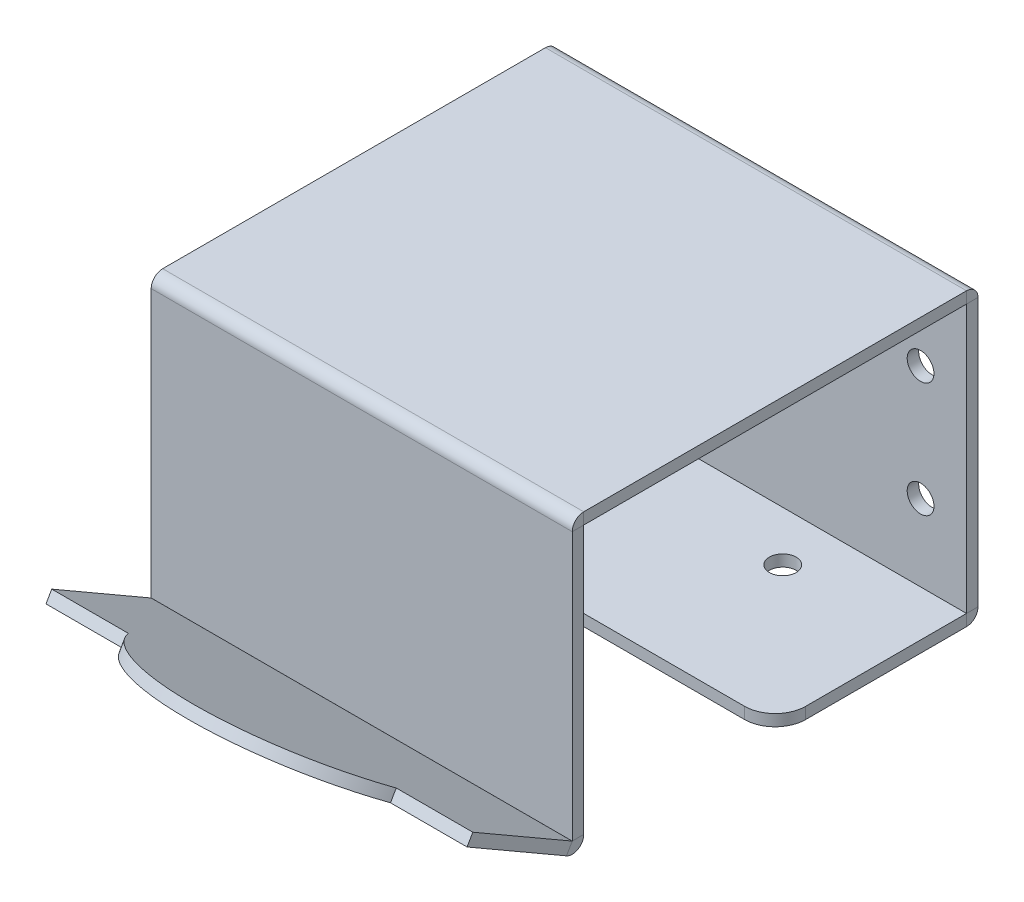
ISO-10303-21;
HEADER;
FILE_DESCRIPTION(('STEP AP214'),'2;1');
FILE_NAME('part.step','',(''),(''),'','','');
FILE_SCHEMA(('AUTOMOTIVE_DESIGN { 1 0 10303 214 1 1 1 1 }'));
ENDSEC;
DATA;
#1=APPLICATION_CONTEXT('core data for automotive mechanical design processes');
#2=APPLICATION_PROTOCOL_DEFINITION('international standard','automotive_design',2000,#1);
#3=PRODUCT_CONTEXT('',#1,'mechanical');
#4=PRODUCT('Part','Part','',(#3));
#5=PRODUCT_RELATED_PRODUCT_CATEGORY('part','',(#4));
#6=PRODUCT_DEFINITION_FORMATION('','',#4);
#7=PRODUCT_DEFINITION_CONTEXT('part definition',#1,'design');
#8=PRODUCT_DEFINITION('design','',#6,#7);
#9=PRODUCT_DEFINITION_SHAPE('','',#8);
#10=(LENGTH_UNIT() NAMED_UNIT(*) SI_UNIT(.MILLI.,.METRE.));
#11=(NAMED_UNIT(*) PLANE_ANGLE_UNIT() SI_UNIT($,.RADIAN.));
#12=(NAMED_UNIT(*) SI_UNIT($,.STERADIAN.) SOLID_ANGLE_UNIT());
#13=UNCERTAINTY_MEASURE_WITH_UNIT(LENGTH_MEASURE(1.E-05),#10,'distance_accuracy_value','');
#14=(GEOMETRIC_REPRESENTATION_CONTEXT(3) GLOBAL_UNCERTAINTY_ASSIGNED_CONTEXT((#13)) GLOBAL_UNIT_ASSIGNED_CONTEXT((#10,
#11,#12)) REPRESENTATION_CONTEXT('',''));
#15=CARTESIAN_POINT('',(0.,0.,0.));
#16=DIRECTION('',(0.,0.,1.));
#17=DIRECTION('',(1.,0.,0.));
#18=AXIS2_PLACEMENT_3D('',#15,#16,#17);
#19=CARTESIAN_POINT('',(51.,166.000023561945,51.4999764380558));
#20=DIRECTION('',(0.,0.,-1.));
#21=DIRECTION('',(1.,0.,0.));
#22=AXIS2_PLACEMENT_3D('',#19,#20,#21);
#23=PLANE('',#22);
#24=DIRECTION('',(0.,-1.,0.));
#25=VECTOR('',#24,1.);
#26=CARTESIAN_POINT('',(55.,166.000023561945,51.4999764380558));
#27=LINE('',#26,#25);
#28=CARTESIAN_POINT('',(55.,59.9999999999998,51.4999764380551));
#29=VERTEX_POINT('',#28);
#30=CARTESIAN_POINT('',(55.,25.0000235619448,51.4999764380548));
#31=VERTEX_POINT('',#30);
#32=EDGE_CURVE('E52',#29,#31,#27,.T.);
#33=ORIENTED_EDGE('',*,*,#32,.T.);
#34=DIRECTION('',(-1.,0.,0.));
#35=VECTOR('',#34,1.);
#36=CARTESIAN_POINT('',(51.,25.0000235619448,51.4999764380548));
#37=LINE('',#36,#35);
#38=CARTESIAN_POINT('',(0.,25.0000235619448,51.4999764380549));
#39=VERTEX_POINT('',#38);
#40=EDGE_CURVE('E401',#31,#39,#37,.T.);
#41=ORIENTED_EDGE('',*,*,#40,.T.);
#42=DIRECTION('',(0.,1.,0.));
#43=VECTOR('',#42,1.);
#44=CARTESIAN_POINT('',(0.,166.000023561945,51.4999764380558));
#45=LINE('',#44,#43);
#46=CARTESIAN_POINT('',(0.,59.9999999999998,51.4999764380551));
#47=VERTEX_POINT('',#46);
#48=EDGE_CURVE('E250',#39,#47,#45,.T.);
#49=ORIENTED_EDGE('',*,*,#48,.T.);
#50=DIRECTION('',(-1.,0.,0.));
#51=VECTOR('',#50,1.);
#52=CARTESIAN_POINT('',(51.,59.9999999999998,51.4999764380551));
#53=LINE('',#52,#51);
#54=EDGE_CURVE('E389',#29,#47,#53,.T.);
#55=ORIENTED_EDGE('',*,*,#54,.F.);
#56=EDGE_LOOP('',(#33,#41,#49,#55));
#57=FACE_BOUND('',#56,.T.);
#58=ADVANCED_FACE('F48',(#57),#23,.T.);
#59=CARTESIAN_POINT('',(51.,60.0000000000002,-54.5000235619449));
#60=DIRECTION('',(0.,-1.,0.));
#61=DIRECTION('',(1.,0.,0.));
#62=AXIS2_PLACEMENT_3D('',#59,#60,#61);
#63=PLANE('',#62);
#64=DIRECTION('',(0.,0.,1.));
#65=VECTOR('',#64,1.);
#66=CARTESIAN_POINT('',(55.,60.0000000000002,-54.5000235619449));
#67=LINE('',#66,#65);
#68=CARTESIAN_POINT('',(55.,60.,1.5));
#69=VERTEX_POINT('',#68);
#70=EDGE_CURVE('E383',#69,#29,#67,.T.);
#71=ORIENTED_EDGE('',*,*,#70,.T.);
#72=ORIENTED_EDGE('',*,*,#54,.T.);
#73=DIRECTION('',(0.,0.,-1.));
#74=VECTOR('',#73,1.);
#75=CARTESIAN_POINT('',(0.,60.0000000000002,-54.5000235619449));
#76=LINE('',#75,#74);
#77=CARTESIAN_POINT('',(0.,60.,1.5));
#78=VERTEX_POINT('',#77);
#79=EDGE_CURVE('E406',#47,#78,#76,.T.);
#80=ORIENTED_EDGE('',*,*,#79,.T.);
#81=DIRECTION('',(-1.,0.,0.));
#82=VECTOR('',#81,1.);
#83=CARTESIAN_POINT('',(51.,60.,1.5));
#84=LINE('',#83,#82);
#85=EDGE_CURVE('E293',#69,#78,#84,.T.);
#86=ORIENTED_EDGE('',*,*,#85,.F.);
#87=EDGE_LOOP('',(#71,#72,#80,#86));
#88=FACE_BOUND('',#87,.T.);
#89=ADVANCED_FACE('F466',(#88),#63,.T.);
#90=CARTESIAN_POINT('',(55.,60.0000000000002,-54.5000235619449));
#91=DIRECTION('',(-1.,0.,0.));
#92=DIRECTION('',(0.,-1.,0.));
#93=AXIS2_PLACEMENT_3D('',#90,#91,#92);
#94=PLANE('',#93);
#95=DIRECTION('',(0.,1.,0.));
#96=VECTOR('',#95,1.);
#97=CARTESIAN_POINT('',(55.,59.9999999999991,51.4999764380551));
#98=LINE('',#97,#96);
#99=CARTESIAN_POINT('',(55.,61.4999999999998,51.4999764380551));
#100=VERTEX_POINT('',#99);
#101=EDGE_CURVE('E392',#29,#100,#98,.T.);
#102=ORIENTED_EDGE('',*,*,#101,.F.);
#103=ORIENTED_EDGE('',*,*,#70,.F.);
#104=DIRECTION('',(0.,1.,0.));
#105=VECTOR('',#104,1.);
#106=CARTESIAN_POINT('',(55.,59.9999999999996,1.5));
#107=LINE('',#106,#105);
#108=CARTESIAN_POINT('',(55.,61.5,1.50000000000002));
#109=VERTEX_POINT('',#108);
#110=EDGE_CURVE('E386',#69,#109,#107,.T.);
#111=ORIENTED_EDGE('',*,*,#110,.T.);
#112=DIRECTION('',(0.,0.,1.));
#113=VECTOR('',#112,1.);
#114=CARTESIAN_POINT('',(55.,61.5000000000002,-54.5000235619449));
#115=LINE('',#114,#113);
#116=EDGE_CURVE('E404',#109,#100,#115,.T.);
#117=ORIENTED_EDGE('',*,*,#116,.T.);
#118=EDGE_LOOP('',(#102,#103,#111,#117));
#119=FACE_BOUND('',#118,.T.);
#120=ADVANCED_FACE('F455',(#119),#94,.F.);
#121=CARTESIAN_POINT('',(0.,60.0000000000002,-54.5000235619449));
#122=DIRECTION('',(1.,0.,0.));
#123=DIRECTION('',(0.,1.,0.));
#124=AXIS2_PLACEMENT_3D('',#121,#122,#123);
#125=PLANE('',#124);
#126=DIRECTION('',(0.,-1.,0.));
#127=VECTOR('',#126,1.);
#128=CARTESIAN_POINT('',(0.,59.9999999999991,51.4999764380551));
#129=LINE('',#128,#127);
#130=CARTESIAN_POINT('',(0.,61.4999999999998,51.4999764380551));
#131=VERTEX_POINT('',#130);
#132=EDGE_CURVE('E398',#131,#47,#129,.T.);
#133=ORIENTED_EDGE('',*,*,#132,.F.);
#134=DIRECTION('',(0.,0.,-1.));
#135=VECTOR('',#134,1.);
#136=CARTESIAN_POINT('',(0.,61.5000000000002,-54.5000235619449));
#137=LINE('',#136,#135);
#138=CARTESIAN_POINT('',(0.,61.5,1.50000000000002));
#139=VERTEX_POINT('',#138);
#140=EDGE_CURVE('E265',#131,#139,#137,.T.);
#141=ORIENTED_EDGE('',*,*,#140,.T.);
#142=DIRECTION('',(0.,-1.,0.));
#143=VECTOR('',#142,1.);
#144=CARTESIAN_POINT('',(0.,59.9999999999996,1.5));
#145=LINE('',#144,#143);
#146=EDGE_CURVE('E379',#139,#78,#145,.T.);
#147=ORIENTED_EDGE('',*,*,#146,.T.);
#148=ORIENTED_EDGE('',*,*,#79,.F.);
#149=EDGE_LOOP('',(#133,#141,#147,#148));
#150=FACE_BOUND('',#149,.T.);
#151=ADVANCED_FACE('F462',(#150),#125,.F.);
#152=CARTESIAN_POINT('',(51.,61.5000000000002,-54.5000235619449));
#153=DIRECTION('',(0.,-1.,0.));
#154=DIRECTION('',(1.,0.,0.));
#155=AXIS2_PLACEMENT_3D('',#152,#153,#154);
#156=PLANE('',#155);
#157=DIRECTION('',(-1.,0.,0.));
#158=VECTOR('',#157,1.);
#159=CARTESIAN_POINT('',(51.,61.4999999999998,51.4999764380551));
#160=LINE('',#159,#158);
#161=EDGE_CURVE('E395',#100,#131,#160,.T.);
#162=ORIENTED_EDGE('',*,*,#161,.F.);
#163=ORIENTED_EDGE('',*,*,#116,.F.);
#164=DIRECTION('',(-1.,0.,0.));
#165=VECTOR('',#164,1.);
#166=CARTESIAN_POINT('',(51.,61.5,1.50000000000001));
#167=LINE('',#166,#165);
#168=EDGE_CURVE('E382',#109,#139,#167,.T.);
#169=ORIENTED_EDGE('',*,*,#168,.T.);
#170=ORIENTED_EDGE('',*,*,#140,.F.);
#171=EDGE_LOOP('',(#162,#163,#169,#170));
#172=FACE_BOUND('',#171,.T.);
#173=ADVANCED_FACE('F460',(#172),#156,.F.);
#174=CARTESIAN_POINT('',(51.,23.5000000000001,22.4999764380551));
#175=DIRECTION('',(0.,1.,0.));
#176=DIRECTION('',(1.,0.,0.));
#177=AXIS2_PLACEMENT_3D('',#174,#175,#176);
#178=PLANE('',#177);
#179=DIRECTION('',(-1.,0.,0.));
#180=VECTOR('',#179,1.);
#181=CARTESIAN_POINT('',(51.,23.5,1.5));
#182=LINE('',#181,#180);
#183=CARTESIAN_POINT('',(55.,23.5,1.50000000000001));
#184=VERTEX_POINT('',#183);
#185=CARTESIAN_POINT('',(0.,23.5,1.50000000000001));
#186=VERTEX_POINT('',#185);
#187=EDGE_CURVE('E328',#184,#186,#182,.T.);
#188=ORIENTED_EDGE('',*,*,#187,.F.);
#189=DIRECTION('',(0.,0.,-1.));
#190=VECTOR('',#189,1.);
#191=CARTESIAN_POINT('',(55.,23.5000000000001,22.4999764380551));
#192=LINE('',#191,#190);
#193=CARTESIAN_POINT('',(55.,23.5000000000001,22.4999764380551));
#194=VERTEX_POINT('',#193);
#195=EDGE_CURVE('E343',#194,#184,#192,.T.);
#196=ORIENTED_EDGE('',*,*,#195,.F.);
#197=CARTESIAN_POINT('',(51.,23.5000000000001,22.4999764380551));
#198=DIRECTION('',(0.,1.,0.));
#199=DIRECTION('',(1.,0.,0.));
#200=AXIS2_PLACEMENT_3D('',#197,#198,#199);
#201=CIRCLE('',#200,4.);
#202=CARTESIAN_POINT('',(51.,23.5000000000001,26.4999764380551));
#203=VERTEX_POINT('',#202);
#204=EDGE_CURVE('E363',#203,#194,#201,.T.);
#205=ORIENTED_EDGE('',*,*,#204,.F.);
#206=DIRECTION('',(1.,0.,0.));
#207=VECTOR('',#206,1.);
#208=CARTESIAN_POINT('',(4.00000000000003,23.5000000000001,26.4999764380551));
#209=LINE('',#208,#207);
#210=CARTESIAN_POINT('',(4.00000000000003,23.5000000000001,26.4999764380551));
#211=VERTEX_POINT('',#210);
#212=EDGE_CURVE('E358',#211,#203,#209,.T.);
#213=ORIENTED_EDGE('',*,*,#212,.F.);
#214=CARTESIAN_POINT('',(4.,23.5000000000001,22.4999764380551));
#215=DIRECTION('',(0.,1.,0.));
#216=DIRECTION('',(-1.,0.,0.));
#217=AXIS2_PLACEMENT_3D('',#214,#215,#216);
#218=CIRCLE('',#217,4.);
#219=CARTESIAN_POINT('',(0.,23.5000000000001,22.4999764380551));
#220=VERTEX_POINT('',#219);
#221=EDGE_CURVE('E353',#220,#211,#218,.T.);
#222=ORIENTED_EDGE('',*,*,#221,.F.);
#223=DIRECTION('',(0.,0.,1.));
#224=VECTOR('',#223,1.);
#225=CARTESIAN_POINT('',(0.,23.5000000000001,22.4999764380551));
#226=LINE('',#225,#224);
#227=EDGE_CURVE('E348',#186,#220,#226,.T.);
#228=ORIENTED_EDGE('',*,*,#227,.F.);
#229=EDGE_LOOP('',(#188,#196,#205,#213,#222,#228));
#230=FACE_BOUND('',#229,.T.);
#231=CARTESIAN_POINT('',(17.5,23.5,7.99997643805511));
#232=DIRECTION('',(0.,1.,0.));
#233=DIRECTION('',(1.,0.,0.));
#234=AXIS2_PLACEMENT_3D('',#231,#232,#233);
#235=CIRCLE('',#234,1.75);
#236=CARTESIAN_POINT('',(19.25,23.5,7.99997643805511));
#237=VERTEX_POINT('',#236);
#238=EDGE_CURVE('E368',#237,#237,#235,.T.);
#239=ORIENTED_EDGE('',*,*,#238,.T.);
#240=EDGE_LOOP('',(#239));
#241=FACE_BOUND('',#240,.T.);
#242=CARTESIAN_POINT('',(37.5,23.5,7.99997643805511));
#243=DIRECTION('',(0.,1.,0.));
#244=DIRECTION('',(1.,0.,0.));
#245=AXIS2_PLACEMENT_3D('',#242,#243,#244);
#246=CIRCLE('',#245,1.75);
#247=CARTESIAN_POINT('',(39.25,23.5,7.99997643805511));
#248=VERTEX_POINT('',#247);
#249=EDGE_CURVE('E365',#248,#248,#246,.T.);
#250=ORIENTED_EDGE('',*,*,#249,.T.);
#251=EDGE_LOOP('',(#250));
#252=FACE_BOUND('',#251,.T.);
#253=ADVANCED_FACE('F515',(#230,#241,#252),#178,.F.);
#254=CARTESIAN_POINT('',(51.,25.0000000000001,22.4999764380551));
#255=DIRECTION('',(0.,-1.,0.));
#256=DIRECTION('',(-1.,0.,0.));
#257=AXIS2_PLACEMENT_3D('',#254,#255,#256);
#258=CYLINDRICAL_SURFACE('',#257,4.);
#259=ORIENTED_EDGE('',*,*,#204,.T.);
#260=DIRECTION('',(0.,-1.,0.));
#261=VECTOR('',#260,1.);
#262=CARTESIAN_POINT('',(55.,25.0000000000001,22.4999764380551));
#263=LINE('',#262,#261);
#264=CARTESIAN_POINT('',(55.,25.0000000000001,22.4999764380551));
#265=VERTEX_POINT('',#264);
#266=EDGE_CURVE('E345',#265,#194,#263,.T.);
#267=ORIENTED_EDGE('',*,*,#266,.F.);
#268=CARTESIAN_POINT('',(51.,25.0000000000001,22.4999764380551));
#269=DIRECTION('',(0.,1.,0.));
#270=DIRECTION('',(1.,0.,0.));
#271=AXIS2_PLACEMENT_3D('',#268,#269,#270);
#272=CIRCLE('',#271,4.);
#273=CARTESIAN_POINT('',(51.,25.0000000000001,26.4999764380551));
#274=VERTEX_POINT('',#273);
#275=EDGE_CURVE('E310',#274,#265,#272,.T.);
#276=ORIENTED_EDGE('',*,*,#275,.F.);
#277=DIRECTION('',(0.,-1.,0.));
#278=VECTOR('',#277,1.);
#279=CARTESIAN_POINT('',(51.,25.0000000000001,26.4999764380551));
#280=LINE('',#279,#278);
#281=EDGE_CURVE('E360',#274,#203,#280,.T.);
#282=ORIENTED_EDGE('',*,*,#281,.T.);
#283=EDGE_LOOP('',(#259,#267,#276,#282));
#284=FACE_BOUND('',#283,.T.);
#285=ADVANCED_FACE('F528',(#284),#258,.T.);
#286=CARTESIAN_POINT('',(4.00000000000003,25.0000000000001,26.4999764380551));
#287=DIRECTION('',(0.,0.,-1.));
#288=DIRECTION('',(0.,1.,0.));
#289=AXIS2_PLACEMENT_3D('',#286,#287,#288);
#290=PLANE('',#289);
#291=ORIENTED_EDGE('',*,*,#212,.T.);
#292=ORIENTED_EDGE('',*,*,#281,.F.);
#293=DIRECTION('',(1.,0.,0.));
#294=VECTOR('',#293,1.);
#295=CARTESIAN_POINT('',(4.00000000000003,25.0000000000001,26.4999764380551));
#296=LINE('',#295,#294);
#297=CARTESIAN_POINT('',(4.00000000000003,25.0000000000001,26.4999764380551));
#298=VERTEX_POINT('',#297);
#299=EDGE_CURVE('E312',#298,#274,#296,.T.);
#300=ORIENTED_EDGE('',*,*,#299,.F.);
#301=DIRECTION('',(0.,-1.,0.));
#302=VECTOR('',#301,1.);
#303=CARTESIAN_POINT('',(4.00000000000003,25.0000000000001,26.4999764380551));
#304=LINE('',#303,#302);
#305=EDGE_CURVE('E355',#298,#211,#304,.T.);
#306=ORIENTED_EDGE('',*,*,#305,.T.);
#307=EDGE_LOOP('',(#291,#292,#300,#306));
#308=FACE_BOUND('',#307,.T.);
#309=ADVANCED_FACE('F524',(#308),#290,.F.);
#310=CARTESIAN_POINT('',(4.,25.0000000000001,22.4999764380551));
#311=DIRECTION('',(0.,-1.,0.));
#312=DIRECTION('',(-1.,0.,0.));
#313=AXIS2_PLACEMENT_3D('',#310,#311,#312);
#314=CYLINDRICAL_SURFACE('',#313,4.);
#315=ORIENTED_EDGE('',*,*,#221,.T.);
#316=ORIENTED_EDGE('',*,*,#305,.F.);
#317=CARTESIAN_POINT('',(4.,25.0000000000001,22.4999764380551));
#318=DIRECTION('',(0.,1.,0.));
#319=DIRECTION('',(-1.,0.,0.));
#320=AXIS2_PLACEMENT_3D('',#317,#318,#319);
#321=CIRCLE('',#320,4.);
#322=CARTESIAN_POINT('',(0.,25.0000000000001,22.4999764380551));
#323=VERTEX_POINT('',#322);
#324=EDGE_CURVE('E314',#323,#298,#321,.T.);
#325=ORIENTED_EDGE('',*,*,#324,.F.);
#326=DIRECTION('',(0.,-1.,0.));
#327=VECTOR('',#326,1.);
#328=CARTESIAN_POINT('',(0.,25.0000000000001,22.4999764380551));
#329=LINE('',#328,#327);
#330=EDGE_CURVE('E350',#323,#220,#329,.T.);
#331=ORIENTED_EDGE('',*,*,#330,.T.);
#332=EDGE_LOOP('',(#315,#316,#325,#331));
#333=FACE_BOUND('',#332,.T.);
#334=ADVANCED_FACE('F521',(#333),#314,.T.);
#335=CARTESIAN_POINT('',(0.,25.0000000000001,22.4999764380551));
#336=DIRECTION('',(1.,0.,0.));
#337=DIRECTION('',(0.,-1.,0.));
#338=AXIS2_PLACEMENT_3D('',#335,#336,#337);
#339=PLANE('',#338);
#340=DIRECTION('',(0.,1.,0.));
#341=VECTOR('',#340,1.);
#342=CARTESIAN_POINT('',(0.,25.0000000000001,1.50000000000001));
#343=LINE('',#342,#341);
#344=CARTESIAN_POINT('',(0.,25.,1.5));
#345=VERTEX_POINT('',#344);
#346=EDGE_CURVE('E323',#186,#345,#343,.T.);
#347=ORIENTED_EDGE('',*,*,#346,.F.);
#348=ORIENTED_EDGE('',*,*,#227,.T.);
#349=ORIENTED_EDGE('',*,*,#330,.F.);
#350=DIRECTION('',(0.,0.,1.));
#351=VECTOR('',#350,1.);
#352=CARTESIAN_POINT('',(0.,25.0000000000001,22.4999764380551));
#353=LINE('',#352,#351);
#354=EDGE_CURVE('E316',#345,#323,#353,.T.);
#355=ORIENTED_EDGE('',*,*,#354,.F.);
#356=EDGE_LOOP('',(#347,#348,#349,#355));
#357=FACE_BOUND('',#356,.T.);
#358=ADVANCED_FACE('F483',(#357),#339,.F.);
#359=CARTESIAN_POINT('',(55.,25.0000000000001,22.4999764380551));
#360=DIRECTION('',(-1.,0.,0.));
#361=DIRECTION('',(0.,1.,0.));
#362=AXIS2_PLACEMENT_3D('',#359,#360,#361);
#363=PLANE('',#362);
#364=DIRECTION('',(0.,-1.,0.));
#365=VECTOR('',#364,1.);
#366=CARTESIAN_POINT('',(55.,25.0000000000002,1.50000000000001));
#367=LINE('',#366,#365);
#368=CARTESIAN_POINT('',(55.,25.,1.5));
#369=VERTEX_POINT('',#368);
#370=EDGE_CURVE('E334',#369,#184,#367,.T.);
#371=ORIENTED_EDGE('',*,*,#370,.F.);
#372=DIRECTION('',(0.,0.,-1.));
#373=VECTOR('',#372,1.);
#374=CARTESIAN_POINT('',(55.,25.0000000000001,22.4999764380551));
#375=LINE('',#374,#373);
#376=EDGE_CURVE('E321',#265,#369,#375,.T.);
#377=ORIENTED_EDGE('',*,*,#376,.F.);
#378=ORIENTED_EDGE('',*,*,#266,.T.);
#379=ORIENTED_EDGE('',*,*,#195,.T.);
#380=EDGE_LOOP('',(#371,#377,#378,#379));
#381=FACE_BOUND('',#380,.T.);
#382=ADVANCED_FACE('F509',(#381),#363,.F.);
#383=CARTESIAN_POINT('',(37.5,25.,7.99997643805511));
#384=DIRECTION('',(0.,-1.,0.));
#385=DIRECTION('',(-1.,0.,0.));
#386=AXIS2_PLACEMENT_3D('',#383,#384,#385);
#387=CYLINDRICAL_SURFACE('',#386,1.75);
#388=CARTESIAN_POINT('',(37.5,25.,7.99997643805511));
#389=DIRECTION('',(0.,1.,0.));
#390=DIRECTION('',(1.,0.,0.));
#391=AXIS2_PLACEMENT_3D('',#388,#389,#390);
#392=CIRCLE('',#391,1.75);
#393=CARTESIAN_POINT('',(39.25,25.,7.99997643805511));
#394=VERTEX_POINT('',#393);
#395=EDGE_CURVE('E340',#394,#394,#392,.T.);
#396=ORIENTED_EDGE('',*,*,#395,.T.);
#397=EDGE_LOOP('',(#396));
#398=FACE_BOUND('',#397,.T.);
#399=ORIENTED_EDGE('',*,*,#249,.F.);
#400=EDGE_LOOP('',(#399));
#401=FACE_BOUND('',#400,.T.);
#402=ADVANCED_FACE('F943',(#398,#401),#387,.F.);
#403=CARTESIAN_POINT('',(17.5,25.,7.99997643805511));
#404=DIRECTION('',(0.,-1.,0.));
#405=DIRECTION('',(-1.,0.,0.));
#406=AXIS2_PLACEMENT_3D('',#403,#404,#405);
#407=CYLINDRICAL_SURFACE('',#406,1.75);
#408=CARTESIAN_POINT('',(17.5,25.,7.99997643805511));
#409=DIRECTION('',(0.,1.,0.));
#410=DIRECTION('',(1.,0.,0.));
#411=AXIS2_PLACEMENT_3D('',#408,#409,#410);
#412=CIRCLE('',#411,1.75);
#413=CARTESIAN_POINT('',(19.25,25.,7.99997643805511));
#414=VERTEX_POINT('',#413);
#415=EDGE_CURVE('E337',#414,#414,#412,.T.);
#416=ORIENTED_EDGE('',*,*,#415,.T.);
#417=EDGE_LOOP('',(#416));
#418=FACE_BOUND('',#417,.T.);
#419=ORIENTED_EDGE('',*,*,#238,.F.);
#420=EDGE_LOOP('',(#419));
#421=FACE_BOUND('',#420,.T.);
#422=ADVANCED_FACE('F629',(#418,#421),#407,.F.);
#423=CARTESIAN_POINT('',(55.,25.0000000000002,1.50000000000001));
#424=DIRECTION('',(1.,0.,0.));
#425=DIRECTION('',(0.,1.,0.));
#426=AXIS2_PLACEMENT_3D('',#423,#424,#425);
#427=PLANE('',#426);
#428=ORIENTED_EDGE('',*,*,#370,.T.);
#429=CARTESIAN_POINT('',(55.,25.,1.5));
#430=DIRECTION('',(1.,0.,0.));
#431=DIRECTION('',(0.,1.,0.));
#432=AXIS2_PLACEMENT_3D('',#429,#430,#431);
#433=CIRCLE('',#432,1.5);
#434=CARTESIAN_POINT('',(55.,25.,0.));
#435=VERTEX_POINT('',#434);
#436=EDGE_CURVE('E331',#184,#435,#433,.T.);
#437=ORIENTED_EDGE('',*,*,#436,.T.);
#438=DIRECTION('',(0.,0.,-1.));
#439=VECTOR('',#438,1.);
#440=CARTESIAN_POINT('',(55.,25.,1.50000000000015));
#441=LINE('',#440,#439);
#442=EDGE_CURVE('E266',#369,#435,#441,.T.);
#443=ORIENTED_EDGE('',*,*,#442,.F.);
#444=EDGE_LOOP('',(#428,#437,#443));
#445=FACE_BOUND('',#444,.T.);
#446=ADVANCED_FACE('F507',(#445),#427,.T.);
#447=CARTESIAN_POINT('',(55.,25.,1.5));
#448=DIRECTION('',(1.,0.,0.));
#449=DIRECTION('',(0.,1.,0.));
#450=AXIS2_PLACEMENT_3D('',#447,#448,#449);
#451=CYLINDRICAL_SURFACE('',#450,1.5);
#452=ORIENTED_EDGE('',*,*,#436,.F.);
#453=ORIENTED_EDGE('',*,*,#187,.T.);
#454=CARTESIAN_POINT('',(0.,25.,1.5));
#455=DIRECTION('',(1.,0.,0.));
#456=DIRECTION('',(0.,1.,0.));
#457=AXIS2_PLACEMENT_3D('',#454,#455,#456);
#458=CIRCLE('',#457,1.5);
#459=CARTESIAN_POINT('',(0.,25.,0.));
#460=VERTEX_POINT('',#459);
#461=EDGE_CURVE('E326',#186,#460,#458,.T.);
#462=ORIENTED_EDGE('',*,*,#461,.T.);
#463=DIRECTION('',(-1.,0.,0.));
#464=VECTOR('',#463,1.);
#465=CARTESIAN_POINT('',(51.,25.,0.));
#466=LINE('',#465,#464);
#467=EDGE_CURVE('E281',#435,#460,#466,.T.);
#468=ORIENTED_EDGE('',*,*,#467,.F.);
#469=EDGE_LOOP('',(#452,#453,#462,#468));
#470=FACE_BOUND('',#469,.T.);
#471=ADVANCED_FACE('F505',(#470),#451,.T.);
#472=CARTESIAN_POINT('',(0.,25.0000000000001,1.50000000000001));
#473=DIRECTION('',(-1.,0.,0.));
#474=DIRECTION('',(0.,-1.,0.));
#475=AXIS2_PLACEMENT_3D('',#472,#473,#474);
#476=PLANE('',#475);
#477=ORIENTED_EDGE('',*,*,#461,.F.);
#478=ORIENTED_EDGE('',*,*,#346,.T.);
#479=DIRECTION('',(0.,0.,1.));
#480=VECTOR('',#479,1.);
#481=CARTESIAN_POINT('',(0.,25.,1.50000000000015));
#482=LINE('',#481,#480);
#483=EDGE_CURVE('E284',#460,#345,#482,.T.);
#484=ORIENTED_EDGE('',*,*,#483,.F.);
#485=EDGE_LOOP('',(#477,#478,#484));
#486=FACE_BOUND('',#485,.T.);
#487=ADVANCED_FACE('F480',(#486),#476,.T.);
#488=CARTESIAN_POINT('',(51.,25.0000000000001,22.4999764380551));
#489=DIRECTION('',(0.,1.,0.));
#490=DIRECTION('',(1.,0.,0.));
#491=AXIS2_PLACEMENT_3D('',#488,#489,#490);
#492=PLANE('',#491);
#493=ORIENTED_EDGE('',*,*,#415,.F.);
#494=EDGE_LOOP('',(#493));
#495=FACE_BOUND('',#494,.T.);
#496=ORIENTED_EDGE('',*,*,#395,.F.);
#497=EDGE_LOOP('',(#496));
#498=FACE_BOUND('',#497,.T.);
#499=ORIENTED_EDGE('',*,*,#376,.T.);
#500=DIRECTION('',(-1.,0.,0.));
#501=VECTOR('',#500,1.);
#502=CARTESIAN_POINT('',(51.,25.,1.5));
#503=LINE('',#502,#501);
#504=EDGE_CURVE('E318',#369,#345,#503,.T.);
#505=ORIENTED_EDGE('',*,*,#504,.T.);
#506=ORIENTED_EDGE('',*,*,#354,.T.);
#507=ORIENTED_EDGE('',*,*,#324,.T.);
#508=ORIENTED_EDGE('',*,*,#299,.T.);
#509=ORIENTED_EDGE('',*,*,#275,.T.);
#510=EDGE_LOOP('',(#499,#505,#506,#507,#508,#509));
#511=FACE_BOUND('',#510,.T.);
#512=ADVANCED_FACE('F487',(#495,#498,#511),#492,.T.);
#513=CARTESIAN_POINT('',(49.,50.,1.5));
#514=DIRECTION('',(0.,0.,-1.));
#515=DIRECTION('',(-1.,0.,0.));
#516=AXIS2_PLACEMENT_3D('',#513,#514,#515);
#517=CYLINDRICAL_SURFACE('',#516,1.75);
#518=CARTESIAN_POINT('',(49.,50.,1.5));
#519=DIRECTION('',(0.,0.,1.));
#520=DIRECTION('',(1.,0.,0.));
#521=AXIS2_PLACEMENT_3D('',#518,#519,#520);
#522=CIRCLE('',#521,1.75);
#523=CARTESIAN_POINT('',(50.75,50.,1.5));
#524=VERTEX_POINT('',#523);
#525=EDGE_CURVE('E307',#524,#524,#522,.T.);
#526=ORIENTED_EDGE('',*,*,#525,.T.);
#527=EDGE_LOOP('',(#526));
#528=FACE_BOUND('',#527,.T.);
#529=CARTESIAN_POINT('',(49.,50.,0.));
#530=DIRECTION('',(0.,0.,1.));
#531=DIRECTION('',(1.,0.,0.));
#532=AXIS2_PLACEMENT_3D('',#529,#530,#531);
#533=CIRCLE('',#532,1.75);
#534=CARTESIAN_POINT('',(50.75,50.,0.));
#535=VERTEX_POINT('',#534);
#536=EDGE_CURVE('E269',#535,#535,#533,.T.);
#537=ORIENTED_EDGE('',*,*,#536,.F.);
#538=EDGE_LOOP('',(#537));
#539=FACE_BOUND('',#538,.T.);
#540=ADVANCED_FACE('F659',(#528,#539),#517,.F.);
#541=CARTESIAN_POINT('',(6.,50.,1.5));
#542=DIRECTION('',(0.,0.,-1.));
#543=DIRECTION('',(-1.,0.,0.));
#544=AXIS2_PLACEMENT_3D('',#541,#542,#543);
#545=CYLINDRICAL_SURFACE('',#544,1.75);
#546=CARTESIAN_POINT('',(6.,50.,1.5));
#547=DIRECTION('',(0.,0.,1.));
#548=DIRECTION('',(1.,0.,0.));
#549=AXIS2_PLACEMENT_3D('',#546,#547,#548);
#550=CIRCLE('',#549,1.75);
#551=CARTESIAN_POINT('',(7.75,50.,1.5));
#552=VERTEX_POINT('',#551);
#553=EDGE_CURVE('E304',#552,#552,#550,.T.);
#554=ORIENTED_EDGE('',*,*,#553,.T.);
#555=EDGE_LOOP('',(#554));
#556=FACE_BOUND('',#555,.T.);
#557=CARTESIAN_POINT('',(6.,50.,0.));
#558=DIRECTION('',(0.,0.,1.));
#559=DIRECTION('',(1.,0.,0.));
#560=AXIS2_PLACEMENT_3D('',#557,#558,#559);
#561=CIRCLE('',#560,1.75);
#562=CARTESIAN_POINT('',(7.75,50.,0.));
#563=VERTEX_POINT('',#562);
#564=EDGE_CURVE('E272',#563,#563,#561,.T.);
#565=ORIENTED_EDGE('',*,*,#564,.F.);
#566=EDGE_LOOP('',(#565));
#567=FACE_BOUND('',#566,.T.);
#568=ADVANCED_FACE('F916',(#556,#567),#545,.F.);
#569=CARTESIAN_POINT('',(6.,35.,1.5));
#570=DIRECTION('',(0.,0.,-1.));
#571=DIRECTION('',(-1.,0.,0.));
#572=AXIS2_PLACEMENT_3D('',#569,#570,#571);
#573=CYLINDRICAL_SURFACE('',#572,1.75);
#574=CARTESIAN_POINT('',(6.,35.,1.5));
#575=DIRECTION('',(0.,0.,1.));
#576=DIRECTION('',(1.,0.,0.));
#577=AXIS2_PLACEMENT_3D('',#574,#575,#576);
#578=CIRCLE('',#577,1.75);
#579=CARTESIAN_POINT('',(7.75,35.,1.5));
#580=VERTEX_POINT('',#579);
#581=EDGE_CURVE('E301',#580,#580,#578,.T.);
#582=ORIENTED_EDGE('',*,*,#581,.T.);
#583=EDGE_LOOP('',(#582));
#584=FACE_BOUND('',#583,.T.);
#585=CARTESIAN_POINT('',(6.,35.,0.));
#586=DIRECTION('',(0.,0.,1.));
#587=DIRECTION('',(1.,0.,0.));
#588=AXIS2_PLACEMENT_3D('',#585,#586,#587);
#589=CIRCLE('',#588,1.75);
#590=CARTESIAN_POINT('',(7.75,35.,0.));
#591=VERTEX_POINT('',#590);
#592=EDGE_CURVE('E275',#591,#591,#589,.T.);
#593=ORIENTED_EDGE('',*,*,#592,.F.);
#594=EDGE_LOOP('',(#593));
#595=FACE_BOUND('',#594,.T.);
#596=ADVANCED_FACE('F905',(#584,#595),#573,.F.);
#597=CARTESIAN_POINT('',(49.,35.,1.5));
#598=DIRECTION('',(0.,0.,-1.));
#599=DIRECTION('',(-1.,0.,0.));
#600=AXIS2_PLACEMENT_3D('',#597,#598,#599);
#601=CYLINDRICAL_SURFACE('',#600,1.75);
#602=CARTESIAN_POINT('',(49.,35.,1.5));
#603=DIRECTION('',(0.,0.,1.));
#604=DIRECTION('',(1.,0.,0.));
#605=AXIS2_PLACEMENT_3D('',#602,#603,#604);
#606=CIRCLE('',#605,1.75);
#607=CARTESIAN_POINT('',(50.75,35.,1.5));
#608=VERTEX_POINT('',#607);
#609=EDGE_CURVE('E298',#608,#608,#606,.T.);
#610=ORIENTED_EDGE('',*,*,#609,.T.);
#611=EDGE_LOOP('',(#610));
#612=FACE_BOUND('',#611,.T.);
#613=CARTESIAN_POINT('',(49.,35.,0.));
#614=DIRECTION('',(0.,0.,1.));
#615=DIRECTION('',(1.,0.,0.));
#616=AXIS2_PLACEMENT_3D('',#613,#614,#615);
#617=CIRCLE('',#616,1.75);
#618=CARTESIAN_POINT('',(50.75,35.,0.));
#619=VERTEX_POINT('',#618);
#620=EDGE_CURVE('E278',#619,#619,#617,.T.);
#621=ORIENTED_EDGE('',*,*,#620,.F.);
#622=EDGE_LOOP('',(#621));
#623=FACE_BOUND('',#622,.T.);
#624=ADVANCED_FACE('F894',(#612,#623),#601,.F.);
#625=CARTESIAN_POINT('',(51.,4.,1.5));
#626=DIRECTION('',(0.,0.,1.));
#627=DIRECTION('',(1.,0.,0.));
#628=AXIS2_PLACEMENT_3D('',#625,#626,#627);
#629=PLANE('',#628);
#630=ORIENTED_EDGE('',*,*,#609,.F.);
#631=EDGE_LOOP('',(#630));
#632=FACE_BOUND('',#631,.T.);
#633=ORIENTED_EDGE('',*,*,#581,.F.);
#634=EDGE_LOOP('',(#633));
#635=FACE_BOUND('',#634,.T.);
#636=ORIENTED_EDGE('',*,*,#553,.F.);
#637=EDGE_LOOP('',(#636));
#638=FACE_BOUND('',#637,.T.);
#639=ORIENTED_EDGE('',*,*,#525,.F.);
#640=EDGE_LOOP('',(#639));
#641=FACE_BOUND('',#640,.T.);
#642=DIRECTION('',(0.,1.,0.));
#643=VECTOR('',#642,1.);
#644=CARTESIAN_POINT('',(55.,4.00000000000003,1.5));
#645=LINE('',#644,#643);
#646=EDGE_CURVE('E296',#369,#69,#645,.T.);
#647=ORIENTED_EDGE('',*,*,#646,.T.);
#648=ORIENTED_EDGE('',*,*,#85,.T.);
#649=DIRECTION('',(0.,-1.,0.));
#650=VECTOR('',#649,1.);
#651=CARTESIAN_POINT('',(0.,4.00000000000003,1.5));
#652=LINE('',#651,#650);
#653=EDGE_CURVE('E290',#78,#345,#652,.T.);
#654=ORIENTED_EDGE('',*,*,#653,.T.);
#655=ORIENTED_EDGE('',*,*,#504,.F.);
#656=EDGE_LOOP('',(#647,#648,#654,#655));
#657=FACE_BOUND('',#656,.T.);
#658=ADVANCED_FACE('F468',(#632,#635,#638,#641,#657),#629,.T.);
#659=CARTESIAN_POINT('',(0.,4.00000000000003,1.5));
#660=DIRECTION('',(1.,0.,0.));
#661=DIRECTION('',(0.,0.,-1.));
#662=AXIS2_PLACEMENT_3D('',#659,#660,#661);
#663=PLANE('',#662);
#664=DIRECTION('',(0.,0.,1.));
#665=VECTOR('',#664,1.);
#666=CARTESIAN_POINT('',(0.,60.,1.50000000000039));
#667=LINE('',#666,#665);
#668=CARTESIAN_POINT('',(0.,60.,0.));
#669=VERTEX_POINT('',#668);
#670=EDGE_CURVE('E371',#669,#78,#667,.T.);
#671=ORIENTED_EDGE('',*,*,#670,.F.);
#672=DIRECTION('',(0.,-1.,0.));
#673=VECTOR('',#672,1.);
#674=CARTESIAN_POINT('',(0.,4.00000000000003,0.));
#675=LINE('',#674,#673);
#676=EDGE_CURVE('E287',#669,#460,#675,.T.);
#677=ORIENTED_EDGE('',*,*,#676,.T.);
#678=ORIENTED_EDGE('',*,*,#483,.T.);
#679=ORIENTED_EDGE('',*,*,#653,.F.);
#680=EDGE_LOOP('',(#671,#677,#678,#679));
#681=FACE_BOUND('',#680,.T.);
#682=ADVANCED_FACE('F476',(#681),#663,.F.);
#683=CARTESIAN_POINT('',(51.,4.,0.));
#684=DIRECTION('',(0.,0.,1.));
#685=DIRECTION('',(1.,0.,0.));
#686=AXIS2_PLACEMENT_3D('',#683,#684,#685);
#687=PLANE('',#686);
#688=DIRECTION('',(-1.,0.,0.));
#689=VECTOR('',#688,1.);
#690=CARTESIAN_POINT('',(51.,60.,0.));
#691=LINE('',#690,#689);
#692=CARTESIAN_POINT('',(55.,60.,0.));
#693=VERTEX_POINT('',#692);
#694=EDGE_CURVE('E374',#693,#669,#691,.T.);
#695=ORIENTED_EDGE('',*,*,#694,.F.);
#696=DIRECTION('',(0.,1.,0.));
#697=VECTOR('',#696,1.);
#698=CARTESIAN_POINT('',(55.,4.00000000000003,0.));
#699=LINE('',#698,#697);
#700=EDGE_CURVE('E263',#435,#693,#699,.T.);
#701=ORIENTED_EDGE('',*,*,#700,.F.);
#702=ORIENTED_EDGE('',*,*,#467,.T.);
#703=ORIENTED_EDGE('',*,*,#676,.F.);
#704=EDGE_LOOP('',(#695,#701,#702,#703));
#705=FACE_BOUND('',#704,.T.);
#706=ORIENTED_EDGE('',*,*,#620,.T.);
#707=EDGE_LOOP('',(#706));
#708=FACE_BOUND('',#707,.T.);
#709=ORIENTED_EDGE('',*,*,#592,.T.);
#710=EDGE_LOOP('',(#709));
#711=FACE_BOUND('',#710,.T.);
#712=ORIENTED_EDGE('',*,*,#564,.T.);
#713=EDGE_LOOP('',(#712));
#714=FACE_BOUND('',#713,.T.);
#715=ORIENTED_EDGE('',*,*,#536,.T.);
#716=EDGE_LOOP('',(#715));
#717=FACE_BOUND('',#716,.T.);
#718=ADVANCED_FACE('F501',(#705,#708,#711,#714,#717),#687,.F.);
#719=CARTESIAN_POINT('',(55.,4.00000000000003,1.5));
#720=DIRECTION('',(-1.,0.,0.));
#721=DIRECTION('',(0.,0.,1.));
#722=AXIS2_PLACEMENT_3D('',#719,#720,#721);
#723=PLANE('',#722);
#724=DIRECTION('',(0.,0.,-1.));
#725=VECTOR('',#724,1.);
#726=CARTESIAN_POINT('',(55.,60.,1.50000000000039));
#727=LINE('',#726,#725);
#728=EDGE_CURVE('E262',#69,#693,#727,.T.);
#729=ORIENTED_EDGE('',*,*,#728,.F.);
#730=ORIENTED_EDGE('',*,*,#646,.F.);
#731=ORIENTED_EDGE('',*,*,#442,.T.);
#732=ORIENTED_EDGE('',*,*,#700,.T.);
#733=EDGE_LOOP('',(#729,#730,#731,#732));
#734=FACE_BOUND('',#733,.T.);
#735=ADVANCED_FACE('F491',(#734),#723,.F.);
#736=CARTESIAN_POINT('',(55.,59.9999999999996,1.5));
#737=DIRECTION('',(-1.,0.,0.));
#738=DIRECTION('',(0.,0.,1.));
#739=AXIS2_PLACEMENT_3D('',#736,#737,#738);
#740=PLANE('',#739);
#741=CARTESIAN_POINT('',(55.,60.,1.5));
#742=DIRECTION('',(-1.,0.,0.));
#743=DIRECTION('',(0.,0.,1.));
#744=AXIS2_PLACEMENT_3D('',#741,#742,#743);
#745=CIRCLE('',#744,1.5);
#746=EDGE_CURVE('E259',#109,#693,#745,.T.);
#747=ORIENTED_EDGE('',*,*,#746,.F.);
#748=ORIENTED_EDGE('',*,*,#110,.F.);
#749=ORIENTED_EDGE('',*,*,#728,.T.);
#750=EDGE_LOOP('',(#747,#748,#749));
#751=FACE_BOUND('',#750,.T.);
#752=ADVANCED_FACE('F497',(#751),#740,.F.);
#753=CARTESIAN_POINT('',(0.,60.,1.5));
#754=DIRECTION('',(-1.,0.,0.));
#755=DIRECTION('',(0.,0.,1.));
#756=AXIS2_PLACEMENT_3D('',#753,#754,#755);
#757=CYLINDRICAL_SURFACE('',#756,1.5);
#758=CARTESIAN_POINT('',(0.,60.,1.5));
#759=DIRECTION('',(-1.,0.,0.));
#760=DIRECTION('',(0.,0.,1.));
#761=AXIS2_PLACEMENT_3D('',#758,#759,#760);
#762=CIRCLE('',#761,1.5);
#763=EDGE_CURVE('E256',#139,#669,#762,.T.);
#764=ORIENTED_EDGE('',*,*,#763,.F.);
#765=ORIENTED_EDGE('',*,*,#168,.F.);
#766=ORIENTED_EDGE('',*,*,#746,.T.);
#767=ORIENTED_EDGE('',*,*,#694,.T.);
#768=EDGE_LOOP('',(#764,#765,#766,#767));
#769=FACE_BOUND('',#768,.T.);
#770=ADVANCED_FACE('F499',(#769),#757,.T.);
#771=CARTESIAN_POINT('',(0.,59.9999999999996,1.49999999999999));
#772=DIRECTION('',(1.,0.,0.));
#773=DIRECTION('',(0.,0.,-1.));
#774=AXIS2_PLACEMENT_3D('',#771,#772,#773);
#775=PLANE('',#774);
#776=ORIENTED_EDGE('',*,*,#146,.F.);
#777=ORIENTED_EDGE('',*,*,#763,.T.);
#778=ORIENTED_EDGE('',*,*,#670,.T.);
#779=EDGE_LOOP('',(#776,#777,#778));
#780=FACE_BOUND('',#779,.T.);
#781=ADVANCED_FACE('F474',(#780),#775,.F.);
#782=CARTESIAN_POINT('',(55.,59.9999999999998,51.4999764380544));
#783=DIRECTION('',(-1.,0.,0.));
#784=DIRECTION('',(0.,0.,1.));
#785=AXIS2_PLACEMENT_3D('',#782,#783,#784);
#786=PLANE('',#785);
#787=CARTESIAN_POINT('',(55.,59.9999999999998,51.4999764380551));
#788=DIRECTION('',(-1.,0.,0.));
#789=DIRECTION('',(0.,0.,1.));
#790=AXIS2_PLACEMENT_3D('',#787,#788,#789);
#791=CIRCLE('',#790,1.5);
#792=CARTESIAN_POINT('',(55.,59.9999999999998,52.9999764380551));
#793=VERTEX_POINT('',#792);
#794=EDGE_CURVE('E253',#793,#100,#791,.T.);
#795=ORIENTED_EDGE('',*,*,#794,.F.);
#796=DIRECTION('',(0.,0.,1.));
#797=VECTOR('',#796,1.);
#798=CARTESIAN_POINT('',(55.,59.9999999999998,51.4999764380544));
#799=LINE('',#798,#797);
#800=EDGE_CURVE('E248',#29,#793,#799,.T.);
#801=ORIENTED_EDGE('',*,*,#800,.F.);
#802=ORIENTED_EDGE('',*,*,#101,.T.);
#803=EDGE_LOOP('',(#795,#801,#802));
#804=FACE_BOUND('',#803,.T.);
#805=ADVANCED_FACE('F451',(#804),#786,.F.);
#806=CARTESIAN_POINT('',(0.,59.9999999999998,51.4999764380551));
#807=DIRECTION('',(-1.,0.,0.));
#808=DIRECTION('',(0.,0.,1.));
#809=AXIS2_PLACEMENT_3D('',#806,#807,#808);
#810=CYLINDRICAL_SURFACE('',#809,1.5);
#811=CARTESIAN_POINT('',(0.,59.9999999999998,51.4999764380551));
#812=DIRECTION('',(-1.,0.,0.));
#813=DIRECTION('',(0.,0.,1.));
#814=AXIS2_PLACEMENT_3D('',#811,#812,#813);
#815=CIRCLE('',#814,1.5);
#816=CARTESIAN_POINT('',(0.,59.9999999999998,52.9999764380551));
#817=VERTEX_POINT('',#816);
#818=EDGE_CURVE('E245',#817,#131,#815,.T.);
#819=ORIENTED_EDGE('',*,*,#818,.F.);
#820=DIRECTION('',(-1.,0.,0.));
#821=VECTOR('',#820,1.);
#822=CARTESIAN_POINT('',(51.,59.9999999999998,52.9999764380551));
#823=LINE('',#822,#821);
#824=EDGE_CURVE('E246',#793,#817,#823,.T.);
#825=ORIENTED_EDGE('',*,*,#824,.F.);
#826=ORIENTED_EDGE('',*,*,#794,.T.);
#827=ORIENTED_EDGE('',*,*,#161,.T.);
#828=EDGE_LOOP('',(#819,#825,#826,#827));
#829=FACE_BOUND('',#828,.T.);
#830=ADVANCED_FACE('F448',(#829),#810,.T.);
#831=CARTESIAN_POINT('',(0.,59.9999999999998,51.4999764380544));
#832=DIRECTION('',(1.,0.,0.));
#833=DIRECTION('',(0.,0.,-1.));
#834=AXIS2_PLACEMENT_3D('',#831,#832,#833);
#835=PLANE('',#834);
#836=DIRECTION('',(0.,0.,-1.));
#837=VECTOR('',#836,1.);
#838=CARTESIAN_POINT('',(0.,59.9999999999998,51.4999764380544));
#839=LINE('',#838,#837);
#840=EDGE_CURVE('E242',#817,#47,#839,.T.);
#841=ORIENTED_EDGE('',*,*,#840,.F.);
#842=ORIENTED_EDGE('',*,*,#818,.T.);
#843=ORIENTED_EDGE('',*,*,#132,.T.);
#844=EDGE_LOOP('',(#841,#842,#843));
#845=FACE_BOUND('',#844,.T.);
#846=ADVANCED_FACE('F443',(#845),#835,.F.);
#847=CARTESIAN_POINT('',(55.,166.000023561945,51.4999764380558));
#848=DIRECTION('',(-1.,0.,0.));
#849=DIRECTION('',(0.,0.,-1.));
#850=AXIS2_PLACEMENT_3D('',#847,#848,#849);
#851=PLANE('',#850);
#852=DIRECTION('',(0.,0.,1.));
#853=VECTOR('',#852,1.);
#854=CARTESIAN_POINT('',(55.,25.0000235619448,51.4999764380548));
#855=LINE('',#854,#853);
#856=CARTESIAN_POINT('',(55.,25.0000235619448,52.9999764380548));
#857=VERTEX_POINT('',#856);
#858=EDGE_CURVE('E412',#31,#857,#855,.T.);
#859=ORIENTED_EDGE('',*,*,#858,.F.);
#860=ORIENTED_EDGE('',*,*,#32,.F.);
#861=ORIENTED_EDGE('',*,*,#800,.T.);
#862=DIRECTION('',(0.,-1.,0.));
#863=VECTOR('',#862,1.);
#864=CARTESIAN_POINT('',(55.,166.000023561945,52.9999764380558));
#865=LINE('',#864,#863);
#866=EDGE_CURVE('E73',#793,#857,#865,.T.);
#867=ORIENTED_EDGE('',*,*,#866,.T.);
#868=EDGE_LOOP('',(#859,#860,#861,#867));
#869=FACE_BOUND('',#868,.T.);
#870=ADVANCED_FACE('F424',(#869),#851,.F.);
#871=CARTESIAN_POINT('',(51.,166.000023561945,52.9999764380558));
#872=DIRECTION('',(0.,0.,-1.));
#873=DIRECTION('',(1.,0.,0.));
#874=AXIS2_PLACEMENT_3D('',#871,#872,#873);
#875=PLANE('',#874);
#876=DIRECTION('',(-1.,0.,0.));
#877=VECTOR('',#876,1.);
#878=CARTESIAN_POINT('',(51.,25.0000235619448,52.9999764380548));
#879=LINE('',#878,#877);
#880=CARTESIAN_POINT('',(0.,25.0000235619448,52.9999764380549));
#881=VERTEX_POINT('',#880);
#882=EDGE_CURVE('E57',#857,#881,#879,.T.);
#883=ORIENTED_EDGE('',*,*,#882,.F.);
#884=ORIENTED_EDGE('',*,*,#866,.F.);
#885=ORIENTED_EDGE('',*,*,#824,.T.);
#886=DIRECTION('',(0.,1.,0.));
#887=VECTOR('',#886,1.);
#888=CARTESIAN_POINT('',(0.,166.000023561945,52.9999764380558));
#889=LINE('',#888,#887);
#890=EDGE_CURVE('E65',#881,#817,#889,.T.);
#891=ORIENTED_EDGE('',*,*,#890,.F.);
#892=EDGE_LOOP('',(#883,#884,#885,#891));
#893=FACE_BOUND('',#892,.T.);
#894=ADVANCED_FACE('F445',(#893),#875,.F.);
#895=CARTESIAN_POINT('',(0.,166.000023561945,51.4999764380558));
#896=DIRECTION('',(1.,0.,0.));
#897=DIRECTION('',(0.,0.,1.));
#898=AXIS2_PLACEMENT_3D('',#895,#896,#897);
#899=PLANE('',#898);
#900=DIRECTION('',(0.,0.,-1.));
#901=VECTOR('',#900,1.);
#902=CARTESIAN_POINT('',(0.,25.0000235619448,51.4999764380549));
#903=LINE('',#902,#901);
#904=EDGE_CURVE('E12',#881,#39,#903,.T.);
#905=ORIENTED_EDGE('',*,*,#904,.F.);
#906=ORIENTED_EDGE('',*,*,#890,.T.);
#907=ORIENTED_EDGE('',*,*,#840,.T.);
#908=ORIENTED_EDGE('',*,*,#48,.F.);
#909=EDGE_LOOP('',(#905,#906,#907,#908));
#910=FACE_BOUND('',#909,.T.);
#911=ADVANCED_FACE('F50',(#910),#899,.F.);
#912=CARTESIAN_POINT('',(55.,25.0000235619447,53.0009764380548));
#913=DIRECTION('',(1.,0.,0.));
#914=DIRECTION('',(0.,0.,-1.));
#915=AXIS2_PLACEMENT_3D('',#912,#913,#914);
#916=PLANE('',#915);
#917=ORIENTED_EDGE('',*,*,#858,.T.);
#918=CARTESIAN_POINT('',(55.,25.0000235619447,53.0009764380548));
#919=DIRECTION('',(-1.,0.,0.));
#920=DIRECTION('',(0.,0.,1.));
#921=AXIS2_PLACEMENT_3D('',#918,#919,#920);
#922=CIRCLE('',#921,0.000999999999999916);
#923=CARTESIAN_POINT('',(55.,24.999157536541,53.0014764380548));
#924=VERTEX_POINT('',#923);
#925=EDGE_CURVE('E238',#857,#924,#922,.T.);
#926=ORIENTED_EDGE('',*,*,#925,.T.);
#927=DIRECTION('',(0.,0.86602540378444,-0.499999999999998));
#928=VECTOR('',#927,1.);
#929=CARTESIAN_POINT('',(55.,23.7001194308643,53.7514764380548));
#930=LINE('',#929,#928);
#931=CARTESIAN_POINT('',(55.,23.7001194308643,53.7514764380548));
#932=VERTEX_POINT('',#931);
#933=EDGE_CURVE('E430',#932,#924,#930,.T.);
#934=ORIENTED_EDGE('',*,*,#933,.F.);
#935=CARTESIAN_POINT('',(55.,25.0000235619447,53.0009764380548));
#936=DIRECTION('',(-1.,0.,0.));
#937=DIRECTION('',(0.,0.,1.));
#938=AXIS2_PLACEMENT_3D('',#935,#936,#937);
#939=CIRCLE('',#938,1.501);
#940=EDGE_CURVE('E229',#31,#932,#939,.T.);
#941=ORIENTED_EDGE('',*,*,#940,.F.);
#942=EDGE_LOOP('',(#917,#926,#934,#941));
#943=FACE_BOUND('',#942,.T.);
#944=ADVANCED_FACE('F428',(#943),#916,.T.);
#945=CARTESIAN_POINT('',(0.,25.0000235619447,53.0009764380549));
#946=DIRECTION('',(-1.,0.,0.));
#947=DIRECTION('',(0.,0.,1.));
#948=AXIS2_PLACEMENT_3D('',#945,#946,#947);
#949=PLANE('',#948);
#950=DIRECTION('',(0.,-0.86602540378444,0.499999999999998));
#951=VECTOR('',#950,1.);
#952=CARTESIAN_POINT('',(0.,23.7001194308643,53.7514764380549));
#953=LINE('',#952,#951);
#954=CARTESIAN_POINT('',(0.,24.999157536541,53.0014764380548));
#955=VERTEX_POINT('',#954);
#956=CARTESIAN_POINT('',(0.,23.7001194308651,53.7514764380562));
#957=VERTEX_POINT('',#956);
#958=EDGE_CURVE('E437',#955,#957,#953,.T.);
#959=ORIENTED_EDGE('',*,*,#958,.F.);
#960=CARTESIAN_POINT('',(0.,25.0000235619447,53.0009764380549));
#961=DIRECTION('',(-1.,0.,0.));
#962=DIRECTION('',(0.,0.,1.));
#963=AXIS2_PLACEMENT_3D('',#960,#961,#962);
#964=CIRCLE('',#963,0.000999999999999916);
#965=EDGE_CURVE('E233',#955,#881,#964,.F.);
#966=ORIENTED_EDGE('',*,*,#965,.T.);
#967=ORIENTED_EDGE('',*,*,#904,.T.);
#968=CARTESIAN_POINT('',(0.,25.0000235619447,53.0009764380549));
#969=DIRECTION('',(1.,0.,0.));
#970=DIRECTION('',(0.,0.,-1.));
#971=AXIS2_PLACEMENT_3D('',#968,#969,#970);
#972=CIRCLE('',#971,1.501);
#973=EDGE_CURVE('E232',#957,#39,#972,.T.);
#974=ORIENTED_EDGE('',*,*,#973,.F.);
#975=EDGE_LOOP('',(#959,#966,#967,#974));
#976=FACE_BOUND('',#975,.T.);
#977=ADVANCED_FACE('F436',(#976),#949,.T.);
#978=CARTESIAN_POINT('',(82.5204507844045,25.0000235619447,53.0009764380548));
#979=DIRECTION('',(-1.,0.,0.));
#980=DIRECTION('',(0.,0.,1.));
#981=AXIS2_PLACEMENT_3D('',#978,#979,#980);
#982=CYLINDRICAL_SURFACE('',#981,1.501);
#983=ORIENTED_EDGE('',*,*,#973,.T.);
#984=ORIENTED_EDGE('',*,*,#40,.F.);
#985=ORIENTED_EDGE('',*,*,#940,.T.);
#986=DIRECTION('',(-1.,0.,0.));
#987=VECTOR('',#986,1.);
#988=CARTESIAN_POINT('',(51.,23.7001194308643,53.7514764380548));
#989=LINE('',#988,#987);
#990=EDGE_CURVE('E226',#932,#957,#989,.T.);
#991=ORIENTED_EDGE('',*,*,#990,.T.);
#992=EDGE_LOOP('',(#983,#984,#985,#991));
#993=FACE_BOUND('',#992,.T.);
#994=ADVANCED_FACE('F432',(#993),#982,.T.);
#995=CARTESIAN_POINT('',(82.5204507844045,25.0000235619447,53.0009764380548));
#996=DIRECTION('',(-1.,0.,0.));
#997=DIRECTION('',(0.,0.,1.));
#998=AXIS2_PLACEMENT_3D('',#995,#996,#997);
#999=CYLINDRICAL_SURFACE('',#998,0.000999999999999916);
#1000=ORIENTED_EDGE('',*,*,#965,.F.);
#1001=DIRECTION('',(-1.,0.,0.));
#1002=VECTOR('',#1001,1.);
#1003=CARTESIAN_POINT('',(51.,24.999157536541,53.0014764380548));
#1004=LINE('',#1003,#1002);
#1005=EDGE_CURVE('E858',#924,#955,#1004,.T.);
#1006=ORIENTED_EDGE('',*,*,#1005,.F.);
#1007=ORIENTED_EDGE('',*,*,#925,.F.);
#1008=ORIENTED_EDGE('',*,*,#882,.T.);
#1009=EDGE_LOOP('',(#1000,#1006,#1007,#1008));
#1010=FACE_BOUND('',#1009,.T.);
#1011=ADVANCED_FACE('F732',(#1010),#999,.F.);
#1012=CARTESIAN_POINT('',(0.,31.1990565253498,66.7400164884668));
#1013=DIRECTION('',(0.,-0.499999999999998,-0.86602540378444));
#1014=DIRECTION('',(0.,0.86602540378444,-0.499999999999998));
#1015=AXIS2_PLACEMENT_3D('',#1012,#1013,#1014);
#1016=PLANE('',#1015);
#1017=DIRECTION('',(-1.,0.,0.));
#1018=VECTOR('',#1017,1.);
#1019=CARTESIAN_POINT('',(0.,32.4980946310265,65.9900164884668));
#1020=LINE('',#1019,#1018);
#1021=CARTESIAN_POINT('',(10.,32.4980946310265,65.9900164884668));
#1022=VERTEX_POINT('',#1021);
#1023=CARTESIAN_POINT('',(0.,32.4980946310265,65.9900164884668));
#1024=VERTEX_POINT('',#1023);
#1025=EDGE_CURVE('E201',#1022,#1024,#1020,.T.);
#1026=ORIENTED_EDGE('',*,*,#1025,.T.);
#1027=DIRECTION('',(0.,0.86602540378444,-0.499999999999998));
#1028=VECTOR('',#1027,1.);
#1029=CARTESIAN_POINT('',(0.,31.1990565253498,66.7400164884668));
#1030=LINE('',#1029,#1028);
#1031=CARTESIAN_POINT('',(0.,31.1990565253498,66.7400164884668));
#1032=VERTEX_POINT('',#1031);
#1033=EDGE_CURVE('E241',#1032,#1024,#1030,.T.);
#1034=ORIENTED_EDGE('',*,*,#1033,.F.);
#1035=DIRECTION('',(-1.,0.,0.));
#1036=VECTOR('',#1035,1.);
#1037=CARTESIAN_POINT('',(0.,31.1990565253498,66.7400164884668));
#1038=LINE('',#1037,#1036);
#1039=CARTESIAN_POINT('',(10.,31.1990565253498,66.7400164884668));
#1040=VERTEX_POINT('',#1039);
#1041=EDGE_CURVE('E852',#1040,#1032,#1038,.T.);
#1042=ORIENTED_EDGE('',*,*,#1041,.F.);
#1043=DIRECTION('',(0.,0.86602540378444,-0.499999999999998));
#1044=VECTOR('',#1043,1.);
#1045=CARTESIAN_POINT('',(10.,31.1990565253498,66.7400164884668));
#1046=LINE('',#1045,#1044);
#1047=EDGE_CURVE('E206',#1040,#1022,#1046,.T.);
#1048=ORIENTED_EDGE('',*,*,#1047,.T.);
#1049=EDGE_LOOP('',(#1026,#1034,#1042,#1048));
#1050=FACE_BOUND('',#1049,.T.);
#1051=ADVANCED_FACE('F725',(#1050),#1016,.F.);
#1052=CARTESIAN_POINT('',(27.5,26.3578273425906,58.3547615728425));
#1053=DIRECTION('',(0.,0.86602540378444,-0.499999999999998));
#1054=DIRECTION('',(-1.,0.,0.));
#1055=AXIS2_PLACEMENT_3D('',#1052,#1053,#1054);
#1056=CYLINDRICAL_SURFACE('',#1055,20.);
#1057=CARTESIAN_POINT('',(27.5,27.6568654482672,57.6047615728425));
#1058=DIRECTION('',(0.,-0.86602540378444,0.499999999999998));
#1059=DIRECTION('',(1.,0.,0.));
#1060=AXIS2_PLACEMENT_3D('',#1057,#1058,#1059);
#1061=CIRCLE('',#1060,20.);
#1062=CARTESIAN_POINT('',(45.,32.4980946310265,65.9900164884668));
#1063=VERTEX_POINT('',#1062);
#1064=EDGE_CURVE('E195',#1063,#1022,#1061,.T.);
#1065=ORIENTED_EDGE('',*,*,#1064,.T.);
#1066=ORIENTED_EDGE('',*,*,#1047,.F.);
#1067=CARTESIAN_POINT('',(27.5,26.3578273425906,58.3547615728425));
#1068=DIRECTION('',(0.,-0.86602540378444,0.499999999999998));
#1069=DIRECTION('',(1.,0.,0.));
#1070=AXIS2_PLACEMENT_3D('',#1067,#1068,#1069);
#1071=CIRCLE('',#1070,20.);
#1072=CARTESIAN_POINT('',(45.,31.1990565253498,66.7400164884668));
#1073=VERTEX_POINT('',#1072);
#1074=EDGE_CURVE('E210',#1073,#1040,#1071,.T.);
#1075=ORIENTED_EDGE('',*,*,#1074,.F.);
#1076=DIRECTION('',(0.,0.86602540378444,-0.499999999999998));
#1077=VECTOR('',#1076,1.);
#1078=CARTESIAN_POINT('',(45.,31.1990565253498,66.7400164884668));
#1079=LINE('',#1078,#1077);
#1080=EDGE_CURVE('E205',#1073,#1063,#1079,.T.);
#1081=ORIENTED_EDGE('',*,*,#1080,.T.);
#1082=EDGE_LOOP('',(#1065,#1066,#1075,#1081));
#1083=FACE_BOUND('',#1082,.T.);
#1084=ADVANCED_FACE('F209',(#1083),#1056,.T.);
#1085=CARTESIAN_POINT('',(45.,31.1990565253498,66.7400164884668));
#1086=DIRECTION('',(0.,-0.499999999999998,-0.86602540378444));
#1087=DIRECTION('',(0.,0.86602540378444,-0.499999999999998));
#1088=AXIS2_PLACEMENT_3D('',#1085,#1086,#1087);
#1089=PLANE('',#1088);
#1090=DIRECTION('',(-1.,0.,0.));
#1091=VECTOR('',#1090,1.);
#1092=CARTESIAN_POINT('',(45.,32.4980946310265,65.9900164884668));
#1093=LINE('',#1092,#1091);
#1094=CARTESIAN_POINT('',(55.,32.4980946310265,65.9900164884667));
#1095=VERTEX_POINT('',#1094);
#1096=EDGE_CURVE('E199',#1095,#1063,#1093,.T.);
#1097=ORIENTED_EDGE('',*,*,#1096,.T.);
#1098=ORIENTED_EDGE('',*,*,#1080,.F.);
#1099=DIRECTION('',(-1.,0.,0.));
#1100=VECTOR('',#1099,1.);
#1101=CARTESIAN_POINT('',(45.,31.1990565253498,66.7400164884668));
#1102=LINE('',#1101,#1100);
#1103=CARTESIAN_POINT('',(55.,31.1990565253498,66.7400164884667));
#1104=VERTEX_POINT('',#1103);
#1105=EDGE_CURVE('E848',#1104,#1073,#1102,.T.);
#1106=ORIENTED_EDGE('',*,*,#1105,.F.);
#1107=DIRECTION('',(0.,0.86602540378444,-0.499999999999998));
#1108=VECTOR('',#1107,1.);
#1109=CARTESIAN_POINT('',(55.,31.1990565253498,66.7400164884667));
#1110=LINE('',#1109,#1108);
#1111=EDGE_CURVE('E218',#1104,#1095,#1110,.T.);
#1112=ORIENTED_EDGE('',*,*,#1111,.T.);
#1113=EDGE_LOOP('',(#1097,#1098,#1106,#1112));
#1114=FACE_BOUND('',#1113,.T.);
#1115=ADVANCED_FACE('F216',(#1114),#1089,.F.);
#1116=CARTESIAN_POINT('',(51.,-46.8009434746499,-68.3599465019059));
#1117=DIRECTION('',(0.,-0.86602540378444,0.499999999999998));
#1118=DIRECTION('',(1.,0.,0.));
#1119=AXIS2_PLACEMENT_3D('',#1116,#1117,#1118);
#1120=PLANE('',#1119);
#1121=ORIENTED_EDGE('',*,*,#990,.F.);
#1122=DIRECTION('',(0.,0.499999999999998,0.86602540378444));
#1123=VECTOR('',#1122,1.);
#1124=CARTESIAN_POINT('',(55.,-46.8009434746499,-68.3599465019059));
#1125=LINE('',#1124,#1123);
#1126=EDGE_CURVE('E220',#932,#1104,#1125,.T.);
#1127=ORIENTED_EDGE('',*,*,#1126,.T.);
#1128=ORIENTED_EDGE('',*,*,#1105,.T.);
#1129=ORIENTED_EDGE('',*,*,#1074,.T.);
#1130=ORIENTED_EDGE('',*,*,#1041,.T.);
#1131=DIRECTION('',(0.,-0.499999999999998,-0.86602540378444));
#1132=VECTOR('',#1131,1.);
#1133=CARTESIAN_POINT('',(0.,-46.8009434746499,-68.3599465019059));
#1134=LINE('',#1133,#1132);
#1135=EDGE_CURVE('E846',#1032,#957,#1134,.T.);
#1136=ORIENTED_EDGE('',*,*,#1135,.T.);
#1137=EDGE_LOOP('',(#1121,#1127,#1128,#1129,#1130,#1136));
#1138=FACE_BOUND('',#1137,.T.);
#1139=ADVANCED_FACE('F754',(#1138),#1120,.T.);
#1140=CARTESIAN_POINT('',(55.,-46.8009434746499,-68.3599465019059));
#1141=DIRECTION('',(-1.,0.,0.));
#1142=DIRECTION('',(0.,-0.86602540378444,0.499999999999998));
#1143=AXIS2_PLACEMENT_3D('',#1140,#1141,#1142);
#1144=PLANE('',#1143);
#1145=ORIENTED_EDGE('',*,*,#1126,.F.);
#1146=ORIENTED_EDGE('',*,*,#933,.T.);
#1147=DIRECTION('',(0.,0.499999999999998,0.86602540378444));
#1148=VECTOR('',#1147,1.);
#1149=CARTESIAN_POINT('',(55.,-45.5019053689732,-69.1099465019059));
#1150=LINE('',#1149,#1148);
#1151=EDGE_CURVE('E856',#924,#1095,#1150,.T.);
#1152=ORIENTED_EDGE('',*,*,#1151,.T.);
#1153=ORIENTED_EDGE('',*,*,#1111,.F.);
#1154=EDGE_LOOP('',(#1145,#1146,#1152,#1153));
#1155=FACE_BOUND('',#1154,.T.);
#1156=ADVANCED_FACE('F760',(#1155),#1144,.F.);
#1157=CARTESIAN_POINT('',(51.,-45.5019053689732,-69.1099465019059));
#1158=DIRECTION('',(0.,-0.86602540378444,0.499999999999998));
#1159=DIRECTION('',(1.,0.,0.));
#1160=AXIS2_PLACEMENT_3D('',#1157,#1158,#1159);
#1161=PLANE('',#1160);
#1162=ORIENTED_EDGE('',*,*,#1151,.F.);
#1163=ORIENTED_EDGE('',*,*,#1005,.T.);
#1164=DIRECTION('',(0.,-0.499999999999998,-0.86602540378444));
#1165=VECTOR('',#1164,1.);
#1166=CARTESIAN_POINT('',(0.,-45.5019053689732,-69.1099465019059));
#1167=LINE('',#1166,#1165);
#1168=EDGE_CURVE('E861',#1024,#955,#1167,.T.);
#1169=ORIENTED_EDGE('',*,*,#1168,.F.);
#1170=ORIENTED_EDGE('',*,*,#1025,.F.);
#1171=ORIENTED_EDGE('',*,*,#1064,.F.);
#1172=ORIENTED_EDGE('',*,*,#1096,.F.);
#1173=EDGE_LOOP('',(#1162,#1163,#1169,#1170,#1171,#1172));
#1174=FACE_BOUND('',#1173,.T.);
#1175=ADVANCED_FACE('F197',(#1174),#1161,.F.);
#1176=CARTESIAN_POINT('',(0.,-46.8009434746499,-68.3599465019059));
#1177=DIRECTION('',(1.,0.,0.));
#1178=DIRECTION('',(0.,0.86602540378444,-0.499999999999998));
#1179=AXIS2_PLACEMENT_3D('',#1176,#1177,#1178);
#1180=PLANE('',#1179);
#1181=ORIENTED_EDGE('',*,*,#1168,.T.);
#1182=ORIENTED_EDGE('',*,*,#958,.T.);
#1183=ORIENTED_EDGE('',*,*,#1135,.F.);
#1184=ORIENTED_EDGE('',*,*,#1033,.T.);
#1185=EDGE_LOOP('',(#1181,#1182,#1183,#1184));
#1186=FACE_BOUND('',#1185,.T.);
#1187=ADVANCED_FACE('F771',(#1186),#1180,.F.);
#1188=CLOSED_SHELL('',(#58,#89,#120,#151,#173,#253,#285,#309,#334,#358,#382,#402,#422,#446,#471,
#487,#512,#540,#568,#596,#624,#658,#682,#718,#735,#752,#770,#781,#805,#830,#846,#870,#894,#911,
#944,#977,#994,#1011,#1051,#1084,#1115,#1139,#1156,#1175,#1187));
#1189=MANIFOLD_SOLID_BREP('B2',#1188);
#1190=ADVANCED_BREP_SHAPE_REPRESENTATION('',(#18,#1189),#14);
#1191=SHAPE_DEFINITION_REPRESENTATION(#9,#1190);
ENDSEC;
END-ISO-10303-21;
